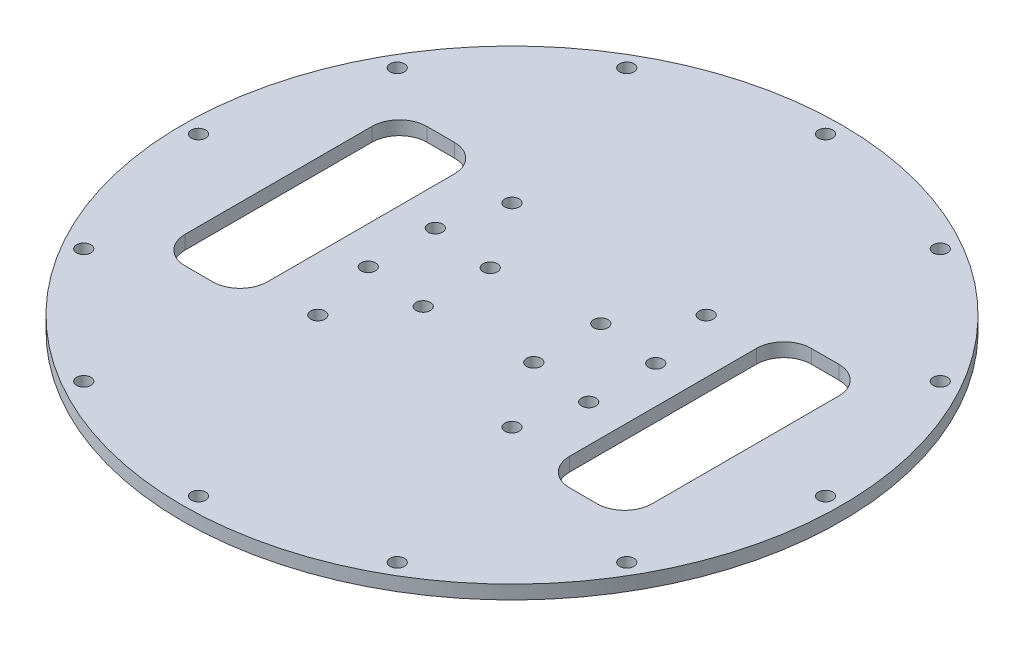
ISO-10303-21;
HEADER;
FILE_DESCRIPTION(('STEP AP214'),'2;1');
FILE_NAME('part.step','',(''),(''),'','','');
FILE_SCHEMA(('AUTOMOTIVE_DESIGN { 1 0 10303 214 1 1 1 1 }'));
ENDSEC;
DATA;
#1=APPLICATION_CONTEXT('core data for automotive mechanical design processes');
#2=APPLICATION_PROTOCOL_DEFINITION('international standard','automotive_design',2000,#1);
#3=PRODUCT_CONTEXT('',#1,'mechanical');
#4=PRODUCT('Part','Part','',(#3));
#5=PRODUCT_RELATED_PRODUCT_CATEGORY('part','',(#4));
#6=PRODUCT_DEFINITION_FORMATION('','',#4);
#7=PRODUCT_DEFINITION_CONTEXT('part definition',#1,'design');
#8=PRODUCT_DEFINITION('design','',#6,#7);
#9=PRODUCT_DEFINITION_SHAPE('','',#8);
#10=(LENGTH_UNIT() NAMED_UNIT(*) SI_UNIT(.MILLI.,.METRE.));
#11=(NAMED_UNIT(*) PLANE_ANGLE_UNIT() SI_UNIT($,.RADIAN.));
#12=(NAMED_UNIT(*) SI_UNIT($,.STERADIAN.) SOLID_ANGLE_UNIT());
#13=UNCERTAINTY_MEASURE_WITH_UNIT(LENGTH_MEASURE(1.E-05),#10,'distance_accuracy_value','');
#14=(GEOMETRIC_REPRESENTATION_CONTEXT(3) GLOBAL_UNCERTAINTY_ASSIGNED_CONTEXT((#13)) GLOBAL_UNIT_ASSIGNED_CONTEXT((#10,
#11,#12)) REPRESENTATION_CONTEXT('',''));
#15=CARTESIAN_POINT('',(0.,0.,0.));
#16=DIRECTION('',(0.,0.,1.));
#17=DIRECTION('',(1.,0.,0.));
#18=AXIS2_PLACEMENT_3D('',#15,#16,#17);
#19=CARTESIAN_POINT('',(-95.25,6.35,43.18));
#20=DIRECTION('',(0.,-1.,0.));
#21=DIRECTION('',(0.,0.,-1.));
#22=AXIS2_PLACEMENT_3D('',#19,#20,#21);
#23=CYLINDRICAL_SURFACE('',#22,12.7);
#24=CARTESIAN_POINT('',(-95.25,0.,43.18));
#25=DIRECTION('',(0.,1.,0.));
#26=DIRECTION('',(0.,0.,1.));
#27=AXIS2_PLACEMENT_3D('',#24,#25,#26);
#28=CIRCLE('',#27,12.7);
#29=CARTESIAN_POINT('',(-107.95,0.,43.18));
#30=VERTEX_POINT('',#29);
#31=CARTESIAN_POINT('',(-95.25,0.,55.88));
#32=VERTEX_POINT('',#31);
#33=EDGE_CURVE('E233',#30,#32,#28,.T.);
#34=ORIENTED_EDGE('',*,*,#33,.F.);
#35=DIRECTION('',(0.,-1.,0.));
#36=VECTOR('',#35,1.);
#37=CARTESIAN_POINT('',(-107.95,6.35,43.18));
#38=LINE('',#37,#36);
#39=CARTESIAN_POINT('',(-107.95,6.35,43.18));
#40=VERTEX_POINT('',#39);
#41=EDGE_CURVE('E11',#40,#30,#38,.T.);
#42=ORIENTED_EDGE('',*,*,#41,.F.);
#43=CARTESIAN_POINT('',(-95.25,6.35,43.18));
#44=DIRECTION('',(0.,1.,0.));
#45=DIRECTION('',(0.,0.,1.));
#46=AXIS2_PLACEMENT_3D('',#43,#44,#45);
#47=CIRCLE('',#46,12.7);
#48=CARTESIAN_POINT('',(-95.25,6.35,55.88));
#49=VERTEX_POINT('',#48);
#50=EDGE_CURVE('E356',#40,#49,#47,.T.);
#51=ORIENTED_EDGE('',*,*,#50,.T.);
#52=DIRECTION('',(0.,-1.,0.));
#53=VECTOR('',#52,1.);
#54=CARTESIAN_POINT('',(-95.25,6.35,55.88));
#55=LINE('',#54,#53);
#56=EDGE_CURVE('E50',#49,#32,#55,.T.);
#57=ORIENTED_EDGE('',*,*,#56,.T.);
#58=EDGE_LOOP('',(#34,#42,#51,#57));
#59=FACE_BOUND('',#58,.T.);
#60=ADVANCED_FACE('F31',(#59),#23,.F.);
#61=CARTESIAN_POINT('',(-107.95,6.35,0.));
#62=DIRECTION('',(1.,0.,0.));
#63=DIRECTION('',(0.,0.,-1.));
#64=AXIS2_PLACEMENT_3D('',#61,#62,#63);
#65=PLANE('',#64);
#66=DIRECTION('',(0.,0.,1.));
#67=VECTOR('',#66,1.);
#68=CARTESIAN_POINT('',(-107.95,0.,0.));
#69=LINE('',#68,#67);
#70=CARTESIAN_POINT('',(-107.95,0.,-43.18));
#71=VERTEX_POINT('',#70);
#72=EDGE_CURVE('E235',#71,#30,#69,.T.);
#73=ORIENTED_EDGE('',*,*,#72,.F.);
#74=DIRECTION('',(0.,-1.,0.));
#75=VECTOR('',#74,1.);
#76=CARTESIAN_POINT('',(-107.95,6.35,-43.18));
#77=LINE('',#76,#75);
#78=CARTESIAN_POINT('',(-107.95,6.35,-43.18));
#79=VERTEX_POINT('',#78);
#80=EDGE_CURVE('E41',#79,#71,#77,.T.);
#81=ORIENTED_EDGE('',*,*,#80,.F.);
#82=DIRECTION('',(0.,0.,1.));
#83=VECTOR('',#82,1.);
#84=CARTESIAN_POINT('',(-107.95,6.35,0.));
#85=LINE('',#84,#83);
#86=EDGE_CURVE('E358',#79,#40,#85,.T.);
#87=ORIENTED_EDGE('',*,*,#86,.T.);
#88=ORIENTED_EDGE('',*,*,#41,.T.);
#89=EDGE_LOOP('',(#73,#81,#87,#88));
#90=FACE_BOUND('',#89,.T.);
#91=ADVANCED_FACE('F389',(#90),#65,.T.);
#92=CARTESIAN_POINT('',(-95.25,6.35,-43.18));
#93=DIRECTION('',(0.,-1.,0.));
#94=DIRECTION('',(0.,0.,-1.));
#95=AXIS2_PLACEMENT_3D('',#92,#93,#94);
#96=CYLINDRICAL_SURFACE('',#95,12.7);
#97=CARTESIAN_POINT('',(-95.25,0.,-43.18));
#98=DIRECTION('',(0.,1.,0.));
#99=DIRECTION('',(0.,0.,1.));
#100=AXIS2_PLACEMENT_3D('',#97,#98,#99);
#101=CIRCLE('',#100,12.7);
#102=CARTESIAN_POINT('',(-95.25,0.,-55.88));
#103=VERTEX_POINT('',#102);
#104=EDGE_CURVE('E238',#103,#71,#101,.T.);
#105=ORIENTED_EDGE('',*,*,#104,.F.);
#106=DIRECTION('',(0.,-1.,0.));
#107=VECTOR('',#106,1.);
#108=CARTESIAN_POINT('',(-95.25,6.35,-55.88));
#109=LINE('',#108,#107);
#110=CARTESIAN_POINT('',(-95.25,6.35,-55.88));
#111=VERTEX_POINT('',#110);
#112=EDGE_CURVE('E274',#111,#103,#109,.T.);
#113=ORIENTED_EDGE('',*,*,#112,.F.);
#114=CARTESIAN_POINT('',(-95.25,6.35,-43.18));
#115=DIRECTION('',(0.,1.,0.));
#116=DIRECTION('',(0.,0.,1.));
#117=AXIS2_PLACEMENT_3D('',#114,#115,#116);
#118=CIRCLE('',#117,12.7);
#119=EDGE_CURVE('E361',#111,#79,#118,.T.);
#120=ORIENTED_EDGE('',*,*,#119,.T.);
#121=ORIENTED_EDGE('',*,*,#80,.T.);
#122=EDGE_LOOP('',(#105,#113,#120,#121));
#123=FACE_BOUND('',#122,.T.);
#124=ADVANCED_FACE('F394',(#123),#96,.F.);
#125=CARTESIAN_POINT('',(-335.421421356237,6.35,-55.88));
#126=DIRECTION('',(0.,0.,1.));
#127=DIRECTION('',(1.,0.,0.));
#128=AXIS2_PLACEMENT_3D('',#125,#126,#127);
#129=PLANE('',#128);
#130=DIRECTION('',(-1.,0.,0.));
#131=VECTOR('',#130,1.);
#132=CARTESIAN_POINT('',(-335.421421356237,0.,-55.88));
#133=LINE('',#132,#131);
#134=CARTESIAN_POINT('',(-82.55,0.,-55.88));
#135=VERTEX_POINT('',#134);
#136=EDGE_CURVE('E241',#135,#103,#133,.T.);
#137=ORIENTED_EDGE('',*,*,#136,.F.);
#138=DIRECTION('',(0.,-1.,0.));
#139=VECTOR('',#138,1.);
#140=CARTESIAN_POINT('',(-82.55,6.35,-55.88));
#141=LINE('',#140,#139);
#142=CARTESIAN_POINT('',(-82.55,6.35,-55.88));
#143=VERTEX_POINT('',#142);
#144=EDGE_CURVE('E272',#143,#135,#141,.T.);
#145=ORIENTED_EDGE('',*,*,#144,.F.);
#146=DIRECTION('',(-1.,0.,0.));
#147=VECTOR('',#146,1.);
#148=CARTESIAN_POINT('',(-335.421421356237,6.35,-55.88));
#149=LINE('',#148,#147);
#150=EDGE_CURVE('E364',#143,#111,#149,.T.);
#151=ORIENTED_EDGE('',*,*,#150,.T.);
#152=ORIENTED_EDGE('',*,*,#112,.T.);
#153=EDGE_LOOP('',(#137,#145,#151,#152));
#154=FACE_BOUND('',#153,.T.);
#155=ADVANCED_FACE('F437',(#154),#129,.T.);
#156=CARTESIAN_POINT('',(-82.55,6.35,-43.18));
#157=DIRECTION('',(0.,-1.,0.));
#158=DIRECTION('',(0.,0.,-1.));
#159=AXIS2_PLACEMENT_3D('',#156,#157,#158);
#160=CYLINDRICAL_SURFACE('',#159,12.7);
#161=CARTESIAN_POINT('',(-82.55,0.,-43.18));
#162=DIRECTION('',(0.,1.,0.));
#163=DIRECTION('',(0.,0.,1.));
#164=AXIS2_PLACEMENT_3D('',#161,#162,#163);
#165=CIRCLE('',#164,12.7);
#166=CARTESIAN_POINT('',(-69.85,0.,-43.18));
#167=VERTEX_POINT('',#166);
#168=EDGE_CURVE('E244',#167,#135,#165,.T.);
#169=ORIENTED_EDGE('',*,*,#168,.F.);
#170=DIRECTION('',(0.,-1.,0.));
#171=VECTOR('',#170,1.);
#172=CARTESIAN_POINT('',(-69.85,6.35,-43.18));
#173=LINE('',#172,#171);
#174=CARTESIAN_POINT('',(-69.85,6.35,-43.18));
#175=VERTEX_POINT('',#174);
#176=EDGE_CURVE('E160',#175,#167,#173,.T.);
#177=ORIENTED_EDGE('',*,*,#176,.F.);
#178=CARTESIAN_POINT('',(-82.55,6.35,-43.18));
#179=DIRECTION('',(0.,1.,0.));
#180=DIRECTION('',(0.,0.,1.));
#181=AXIS2_PLACEMENT_3D('',#178,#179,#180);
#182=CIRCLE('',#181,12.7);
#183=EDGE_CURVE('E172',#175,#143,#182,.T.);
#184=ORIENTED_EDGE('',*,*,#183,.T.);
#185=ORIENTED_EDGE('',*,*,#144,.T.);
#186=EDGE_LOOP('',(#169,#177,#184,#185));
#187=FACE_BOUND('',#186,.T.);
#188=ADVANCED_FACE('F368',(#187),#160,.F.);
#189=CARTESIAN_POINT('',(-69.85,6.35,0.));
#190=DIRECTION('',(-1.,0.,0.));
#191=DIRECTION('',(0.,0.,1.));
#192=AXIS2_PLACEMENT_3D('',#189,#190,#191);
#193=PLANE('',#192);
#194=DIRECTION('',(0.,0.,-1.));
#195=VECTOR('',#194,1.);
#196=CARTESIAN_POINT('',(-69.85,0.,0.));
#197=LINE('',#196,#195);
#198=CARTESIAN_POINT('',(-69.85,0.,43.18));
#199=VERTEX_POINT('',#198);
#200=EDGE_CURVE('E156',#199,#167,#197,.T.);
#201=ORIENTED_EDGE('',*,*,#200,.F.);
#202=DIRECTION('',(0.,-1.,0.));
#203=VECTOR('',#202,1.);
#204=CARTESIAN_POINT('',(-69.85,6.35,43.18));
#205=LINE('',#204,#203);
#206=CARTESIAN_POINT('',(-69.85,6.35,43.18));
#207=VERTEX_POINT('',#206);
#208=EDGE_CURVE('E151',#207,#199,#205,.T.);
#209=ORIENTED_EDGE('',*,*,#208,.F.);
#210=DIRECTION('',(0.,0.,-1.));
#211=VECTOR('',#210,1.);
#212=CARTESIAN_POINT('',(-69.85,6.35,0.));
#213=LINE('',#212,#211);
#214=EDGE_CURVE('E154',#207,#175,#213,.T.);
#215=ORIENTED_EDGE('',*,*,#214,.T.);
#216=ORIENTED_EDGE('',*,*,#176,.T.);
#217=EDGE_LOOP('',(#201,#209,#215,#216));
#218=FACE_BOUND('',#217,.T.);
#219=ADVANCED_FACE('F153',(#218),#193,.T.);
#220=CARTESIAN_POINT('',(-82.55,6.35,43.18));
#221=DIRECTION('',(0.,-1.,0.));
#222=DIRECTION('',(0.,0.,-1.));
#223=AXIS2_PLACEMENT_3D('',#220,#221,#222);
#224=CYLINDRICAL_SURFACE('',#223,12.7);
#225=CARTESIAN_POINT('',(-82.55,0.,43.18));
#226=DIRECTION('',(0.,1.,0.));
#227=DIRECTION('',(0.,0.,1.));
#228=AXIS2_PLACEMENT_3D('',#225,#226,#227);
#229=CIRCLE('',#228,12.7);
#230=CARTESIAN_POINT('',(-82.55,0.,55.88));
#231=VERTEX_POINT('',#230);
#232=EDGE_CURVE('E248',#231,#199,#229,.T.);
#233=ORIENTED_EDGE('',*,*,#232,.F.);
#234=DIRECTION('',(0.,-1.,0.));
#235=VECTOR('',#234,1.);
#236=CARTESIAN_POINT('',(-82.55,6.35,55.88));
#237=LINE('',#236,#235);
#238=CARTESIAN_POINT('',(-82.55,6.35,55.88));
#239=VERTEX_POINT('',#238);
#240=EDGE_CURVE('E99',#239,#231,#237,.T.);
#241=ORIENTED_EDGE('',*,*,#240,.F.);
#242=CARTESIAN_POINT('',(-82.55,6.35,43.18));
#243=DIRECTION('',(0.,1.,0.));
#244=DIRECTION('',(0.,0.,1.));
#245=AXIS2_PLACEMENT_3D('',#242,#243,#244);
#246=CIRCLE('',#245,12.7);
#247=EDGE_CURVE('E169',#239,#207,#246,.T.);
#248=ORIENTED_EDGE('',*,*,#247,.T.);
#249=ORIENTED_EDGE('',*,*,#208,.T.);
#250=EDGE_LOOP('',(#233,#241,#248,#249));
#251=FACE_BOUND('',#250,.T.);
#252=ADVANCED_FACE('F174',(#251),#224,.F.);
#253=CARTESIAN_POINT('',(82.55,6.35,43.18));
#254=DIRECTION('',(0.,-1.,0.));
#255=DIRECTION('',(0.,0.,-1.));
#256=AXIS2_PLACEMENT_3D('',#253,#254,#255);
#257=CYLINDRICAL_SURFACE('',#256,12.7);
#258=CARTESIAN_POINT('',(82.55,0.,43.18));
#259=DIRECTION('',(0.,1.,0.));
#260=DIRECTION('',(0.,0.,1.));
#261=AXIS2_PLACEMENT_3D('',#258,#259,#260);
#262=CIRCLE('',#261,12.7);
#263=CARTESIAN_POINT('',(69.85,0.,43.18));
#264=VERTEX_POINT('',#263);
#265=CARTESIAN_POINT('',(82.55,0.,55.88));
#266=VERTEX_POINT('',#265);
#267=EDGE_CURVE('E196',#264,#266,#262,.T.);
#268=ORIENTED_EDGE('',*,*,#267,.F.);
#269=DIRECTION('',(0.,-1.,0.));
#270=VECTOR('',#269,1.);
#271=CARTESIAN_POINT('',(69.85,6.35,43.18));
#272=LINE('',#271,#270);
#273=CARTESIAN_POINT('',(69.85,6.35,43.18));
#274=VERTEX_POINT('',#273);
#275=EDGE_CURVE('E35',#274,#264,#272,.T.);
#276=ORIENTED_EDGE('',*,*,#275,.F.);
#277=CARTESIAN_POINT('',(82.55,6.35,43.18));
#278=DIRECTION('',(0.,1.,0.));
#279=DIRECTION('',(0.,0.,1.));
#280=AXIS2_PLACEMENT_3D('',#277,#278,#279);
#281=CIRCLE('',#280,12.7);
#282=CARTESIAN_POINT('',(82.55,6.35,55.88));
#283=VERTEX_POINT('',#282);
#284=EDGE_CURVE('E268',#274,#283,#281,.T.);
#285=ORIENTED_EDGE('',*,*,#284,.T.);
#286=DIRECTION('',(0.,-1.,0.));
#287=VECTOR('',#286,1.);
#288=CARTESIAN_POINT('',(82.55,6.35,55.88));
#289=LINE('',#288,#287);
#290=EDGE_CURVE('E195',#283,#266,#289,.T.);
#291=ORIENTED_EDGE('',*,*,#290,.T.);
#292=EDGE_LOOP('',(#268,#276,#285,#291));
#293=FACE_BOUND('',#292,.T.);
#294=ADVANCED_FACE('F33',(#293),#257,.F.);
#295=CARTESIAN_POINT('',(69.85,6.35,0.));
#296=DIRECTION('',(-1.,0.,0.));
#297=DIRECTION('',(0.,0.,1.));
#298=AXIS2_PLACEMENT_3D('',#295,#296,#297);
#299=PLANE('',#298);
#300=DIRECTION('',(0.,0.,-1.));
#301=VECTOR('',#300,1.);
#302=CARTESIAN_POINT('',(69.85,0.,0.));
#303=LINE('',#302,#301);
#304=CARTESIAN_POINT('',(69.85,0.,-43.18));
#305=VERTEX_POINT('',#304);
#306=EDGE_CURVE('E199',#264,#305,#303,.T.);
#307=ORIENTED_EDGE('',*,*,#306,.T.);
#308=DIRECTION('',(0.,-1.,0.));
#309=VECTOR('',#308,1.);
#310=CARTESIAN_POINT('',(69.85,6.35,-43.18));
#311=LINE('',#310,#309);
#312=CARTESIAN_POINT('',(69.85,6.35,-43.18));
#313=VERTEX_POINT('',#312);
#314=EDGE_CURVE('E287',#313,#305,#311,.T.);
#315=ORIENTED_EDGE('',*,*,#314,.F.);
#316=DIRECTION('',(0.,0.,-1.));
#317=VECTOR('',#316,1.);
#318=CARTESIAN_POINT('',(69.85,6.35,0.));
#319=LINE('',#318,#317);
#320=EDGE_CURVE('E295',#274,#313,#319,.T.);
#321=ORIENTED_EDGE('',*,*,#320,.F.);
#322=ORIENTED_EDGE('',*,*,#275,.T.);
#323=EDGE_LOOP('',(#307,#315,#321,#322));
#324=FACE_BOUND('',#323,.T.);
#325=ADVANCED_FACE('F294',(#324),#299,.F.);
#326=CARTESIAN_POINT('',(82.55,6.35,-43.18));
#327=DIRECTION('',(0.,-1.,0.));
#328=DIRECTION('',(0.,0.,-1.));
#329=AXIS2_PLACEMENT_3D('',#326,#327,#328);
#330=CYLINDRICAL_SURFACE('',#329,12.7);
#331=CARTESIAN_POINT('',(82.55,0.,-43.18));
#332=DIRECTION('',(0.,1.,0.));
#333=DIRECTION('',(0.,0.,1.));
#334=AXIS2_PLACEMENT_3D('',#331,#332,#333);
#335=CIRCLE('',#334,12.7);
#336=CARTESIAN_POINT('',(82.55,0.,-55.88));
#337=VERTEX_POINT('',#336);
#338=EDGE_CURVE('E203',#337,#305,#335,.T.);
#339=ORIENTED_EDGE('',*,*,#338,.F.);
#340=DIRECTION('',(0.,-1.,0.));
#341=VECTOR('',#340,1.);
#342=CARTESIAN_POINT('',(82.55,6.35,-55.88));
#343=LINE('',#342,#341);
#344=CARTESIAN_POINT('',(82.55,6.35,-55.88));
#345=VERTEX_POINT('',#344);
#346=EDGE_CURVE('E286',#345,#337,#343,.T.);
#347=ORIENTED_EDGE('',*,*,#346,.F.);
#348=CARTESIAN_POINT('',(82.55,6.35,-43.18));
#349=DIRECTION('',(0.,1.,0.));
#350=DIRECTION('',(0.,0.,1.));
#351=AXIS2_PLACEMENT_3D('',#348,#349,#350);
#352=CIRCLE('',#351,12.7);
#353=EDGE_CURVE('E329',#345,#313,#352,.T.);
#354=ORIENTED_EDGE('',*,*,#353,.T.);
#355=ORIENTED_EDGE('',*,*,#314,.T.);
#356=EDGE_LOOP('',(#339,#347,#354,#355));
#357=FACE_BOUND('',#356,.T.);
#358=ADVANCED_FACE('F327',(#357),#330,.F.);
#359=CARTESIAN_POINT('',(-335.421421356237,6.35,-55.88));
#360=DIRECTION('',(0.,0.,-1.));
#361=DIRECTION('',(-1.,0.,0.));
#362=AXIS2_PLACEMENT_3D('',#359,#360,#361);
#363=PLANE('',#362);
#364=DIRECTION('',(1.,0.,0.));
#365=VECTOR('',#364,1.);
#366=CARTESIAN_POINT('',(-335.421421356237,0.,-55.88));
#367=LINE('',#366,#365);
#368=CARTESIAN_POINT('',(95.25,0.,-55.88));
#369=VERTEX_POINT('',#368);
#370=EDGE_CURVE('E206',#337,#369,#367,.T.);
#371=ORIENTED_EDGE('',*,*,#370,.T.);
#372=DIRECTION('',(0.,-1.,0.));
#373=VECTOR('',#372,1.);
#374=CARTESIAN_POINT('',(95.25,6.35,-55.88));
#375=LINE('',#374,#373);
#376=CARTESIAN_POINT('',(95.25,6.35,-55.88));
#377=VERTEX_POINT('',#376);
#378=EDGE_CURVE('E284',#377,#369,#375,.T.);
#379=ORIENTED_EDGE('',*,*,#378,.F.);
#380=DIRECTION('',(1.,0.,0.));
#381=VECTOR('',#380,1.);
#382=CARTESIAN_POINT('',(-335.421421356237,6.35,-55.88));
#383=LINE('',#382,#381);
#384=EDGE_CURVE('E330',#345,#377,#383,.T.);
#385=ORIENTED_EDGE('',*,*,#384,.F.);
#386=ORIENTED_EDGE('',*,*,#346,.T.);
#387=EDGE_LOOP('',(#371,#379,#385,#386));
#388=FACE_BOUND('',#387,.T.);
#389=ADVANCED_FACE('F326',(#388),#363,.F.);
#390=CARTESIAN_POINT('',(95.25,6.35,-43.18));
#391=DIRECTION('',(0.,-1.,0.));
#392=DIRECTION('',(0.,0.,-1.));
#393=AXIS2_PLACEMENT_3D('',#390,#391,#392);
#394=CYLINDRICAL_SURFACE('',#393,12.7);
#395=CARTESIAN_POINT('',(95.25,0.,-43.18));
#396=DIRECTION('',(0.,1.,0.));
#397=DIRECTION('',(0.,0.,1.));
#398=AXIS2_PLACEMENT_3D('',#395,#396,#397);
#399=CIRCLE('',#398,12.7);
#400=CARTESIAN_POINT('',(107.95,0.,-43.18));
#401=VERTEX_POINT('',#400);
#402=EDGE_CURVE('E209',#401,#369,#399,.T.);
#403=ORIENTED_EDGE('',*,*,#402,.F.);
#404=DIRECTION('',(0.,-1.,0.));
#405=VECTOR('',#404,1.);
#406=CARTESIAN_POINT('',(107.95,6.35,-43.18));
#407=LINE('',#406,#405);
#408=CARTESIAN_POINT('',(107.95,6.35,-43.18));
#409=VERTEX_POINT('',#408);
#410=EDGE_CURVE('E282',#409,#401,#407,.T.);
#411=ORIENTED_EDGE('',*,*,#410,.F.);
#412=CARTESIAN_POINT('',(95.25,6.35,-43.18));
#413=DIRECTION('',(0.,1.,0.));
#414=DIRECTION('',(0.,0.,1.));
#415=AXIS2_PLACEMENT_3D('',#412,#413,#414);
#416=CIRCLE('',#415,12.7);
#417=EDGE_CURVE('E323',#409,#377,#416,.T.);
#418=ORIENTED_EDGE('',*,*,#417,.T.);
#419=ORIENTED_EDGE('',*,*,#378,.T.);
#420=EDGE_LOOP('',(#403,#411,#418,#419));
#421=FACE_BOUND('',#420,.T.);
#422=ADVANCED_FACE('F319',(#421),#394,.F.);
#423=CARTESIAN_POINT('',(107.95,6.35,0.));
#424=DIRECTION('',(1.,0.,0.));
#425=DIRECTION('',(0.,0.,-1.));
#426=AXIS2_PLACEMENT_3D('',#423,#424,#425);
#427=PLANE('',#426);
#428=DIRECTION('',(0.,0.,1.));
#429=VECTOR('',#428,1.);
#430=CARTESIAN_POINT('',(107.95,0.,0.));
#431=LINE('',#430,#429);
#432=CARTESIAN_POINT('',(107.95,0.,43.18));
#433=VERTEX_POINT('',#432);
#434=EDGE_CURVE('E212',#401,#433,#431,.T.);
#435=ORIENTED_EDGE('',*,*,#434,.T.);
#436=DIRECTION('',(0.,-1.,0.));
#437=VECTOR('',#436,1.);
#438=CARTESIAN_POINT('',(107.95,6.35,43.18));
#439=LINE('',#438,#437);
#440=CARTESIAN_POINT('',(107.95,6.35,43.18));
#441=VERTEX_POINT('',#440);
#442=EDGE_CURVE('E280',#441,#433,#439,.T.);
#443=ORIENTED_EDGE('',*,*,#442,.F.);
#444=DIRECTION('',(0.,0.,1.));
#445=VECTOR('',#444,1.);
#446=CARTESIAN_POINT('',(107.95,6.35,0.));
#447=LINE('',#446,#445);
#448=EDGE_CURVE('E339',#409,#441,#447,.T.);
#449=ORIENTED_EDGE('',*,*,#448,.F.);
#450=ORIENTED_EDGE('',*,*,#410,.T.);
#451=EDGE_LOOP('',(#435,#443,#449,#450));
#452=FACE_BOUND('',#451,.T.);
#453=ADVANCED_FACE('F316',(#452),#427,.F.);
#454=CARTESIAN_POINT('',(95.25,6.35,43.18));
#455=DIRECTION('',(0.,-1.,0.));
#456=DIRECTION('',(0.,0.,-1.));
#457=AXIS2_PLACEMENT_3D('',#454,#455,#456);
#458=CYLINDRICAL_SURFACE('',#457,12.7);
#459=CARTESIAN_POINT('',(95.25,0.,43.18));
#460=DIRECTION('',(0.,1.,0.));
#461=DIRECTION('',(0.,0.,1.));
#462=AXIS2_PLACEMENT_3D('',#459,#460,#461);
#463=CIRCLE('',#462,12.7);
#464=CARTESIAN_POINT('',(95.25,0.,55.88));
#465=VERTEX_POINT('',#464);
#466=EDGE_CURVE('E215',#465,#433,#463,.T.);
#467=ORIENTED_EDGE('',*,*,#466,.F.);
#468=DIRECTION('',(0.,-1.,0.));
#469=VECTOR('',#468,1.);
#470=CARTESIAN_POINT('',(95.25,6.35,55.88));
#471=LINE('',#470,#469);
#472=CARTESIAN_POINT('',(95.25,6.35,55.88));
#473=VERTEX_POINT('',#472);
#474=EDGE_CURVE('E278',#473,#465,#471,.T.);
#475=ORIENTED_EDGE('',*,*,#474,.F.);
#476=CARTESIAN_POINT('',(95.25,6.35,43.18));
#477=DIRECTION('',(0.,1.,0.));
#478=DIRECTION('',(0.,0.,1.));
#479=AXIS2_PLACEMENT_3D('',#476,#477,#478);
#480=CIRCLE('',#479,12.7);
#481=EDGE_CURVE('E313',#473,#441,#480,.T.);
#482=ORIENTED_EDGE('',*,*,#481,.T.);
#483=ORIENTED_EDGE('',*,*,#442,.T.);
#484=EDGE_LOOP('',(#467,#475,#482,#483));
#485=FACE_BOUND('',#484,.T.);
#486=ADVANCED_FACE('F309',(#485),#458,.F.);
#487=CARTESIAN_POINT('',(-23.98131856,6.35,-13.91245376));
#488=DIRECTION('',(0.,-1.,0.));
#489=DIRECTION('',(0.,0.,-1.));
#490=AXIS2_PLACEMENT_3D('',#487,#488,#489);
#491=CYLINDRICAL_SURFACE('',#490,3.302);
#492=CARTESIAN_POINT('',(-23.98131856,6.35,-13.91245376));
#493=DIRECTION('',(0.,1.,0.));
#494=DIRECTION('',(0.,0.,1.));
#495=AXIS2_PLACEMENT_3D('',#492,#493,#494);
#496=CIRCLE('',#495,3.302);
#497=CARTESIAN_POINT('',(-23.98131856,6.35,-10.61045376));
#498=VERTEX_POINT('',#497);
#499=EDGE_CURVE('E189',#498,#498,#496,.T.);
#500=ORIENTED_EDGE('',*,*,#499,.T.);
#501=EDGE_LOOP('',(#500));
#502=FACE_BOUND('',#501,.T.);
#503=CARTESIAN_POINT('',(-23.98131856,0.,-13.91245376));
#504=DIRECTION('',(0.,1.,0.));
#505=DIRECTION('',(0.,0.,1.));
#506=AXIS2_PLACEMENT_3D('',#503,#504,#505);
#507=CIRCLE('',#506,3.302);
#508=CARTESIAN_POINT('',(-23.98131856,0.,-10.61045376));
#509=VERTEX_POINT('',#508);
#510=EDGE_CURVE('E262',#509,#509,#507,.T.);
#511=ORIENTED_EDGE('',*,*,#510,.F.);
#512=EDGE_LOOP('',(#511));
#513=FACE_BOUND('',#512,.T.);
#514=ADVANCED_FACE('F415',(#502,#513),#491,.F.);
#515=CARTESIAN_POINT('',(-23.98131856,6.35,17.08745376));
#516=DIRECTION('',(0.,-1.,0.));
#517=DIRECTION('',(0.,0.,-1.));
#518=AXIS2_PLACEMENT_3D('',#515,#516,#517);
#519=CYLINDRICAL_SURFACE('',#518,3.302);
#520=CARTESIAN_POINT('',(-23.98131856,6.35,17.08745376));
#521=DIRECTION('',(0.,1.,0.));
#522=DIRECTION('',(0.,0.,1.));
#523=AXIS2_PLACEMENT_3D('',#520,#521,#522);
#524=CIRCLE('',#523,3.302);
#525=CARTESIAN_POINT('',(-23.98131856,6.35,20.38945376));
#526=VERTEX_POINT('',#525);
#527=EDGE_CURVE('E186',#526,#526,#524,.T.);
#528=ORIENTED_EDGE('',*,*,#527,.T.);
#529=EDGE_LOOP('',(#528));
#530=FACE_BOUND('',#529,.T.);
#531=CARTESIAN_POINT('',(-23.98131856,0.,17.08745376));
#532=DIRECTION('',(0.,1.,0.));
#533=DIRECTION('',(0.,0.,1.));
#534=AXIS2_PLACEMENT_3D('',#531,#532,#533);
#535=CIRCLE('',#534,3.302);
#536=CARTESIAN_POINT('',(-23.98131856,0.,20.38945376));
#537=VERTEX_POINT('',#536);
#538=EDGE_CURVE('E259',#537,#537,#535,.T.);
#539=ORIENTED_EDGE('',*,*,#538,.F.);
#540=EDGE_LOOP('',(#539));
#541=FACE_BOUND('',#540,.T.);
#542=ADVANCED_FACE('F513',(#530,#541),#519,.F.);
#543=CARTESIAN_POINT('',(-52.55631856,6.35,-17.08745376));
#544=DIRECTION('',(0.,-1.,0.));
#545=DIRECTION('',(0.,0.,-1.));
#546=AXIS2_PLACEMENT_3D('',#543,#544,#545);
#547=CYLINDRICAL_SURFACE('',#546,3.302);
#548=CARTESIAN_POINT('',(-52.55631856,6.35,-17.08745376));
#549=DIRECTION('',(0.,1.,0.));
#550=DIRECTION('',(0.,0.,1.));
#551=AXIS2_PLACEMENT_3D('',#548,#549,#550);
#552=CIRCLE('',#551,3.302);
#553=CARTESIAN_POINT('',(-52.55631856,6.35,-13.78545376));
#554=VERTEX_POINT('',#553);
#555=EDGE_CURVE('E183',#554,#554,#552,.T.);
#556=ORIENTED_EDGE('',*,*,#555,.T.);
#557=EDGE_LOOP('',(#556));
#558=FACE_BOUND('',#557,.T.);
#559=CARTESIAN_POINT('',(-52.55631856,0.,-17.08745376));
#560=DIRECTION('',(0.,1.,0.));
#561=DIRECTION('',(0.,0.,1.));
#562=AXIS2_PLACEMENT_3D('',#559,#560,#561);
#563=CIRCLE('',#562,3.302);
#564=CARTESIAN_POINT('',(-52.55631856,0.,-13.78545376));
#565=VERTEX_POINT('',#564);
#566=EDGE_CURVE('E256',#565,#565,#563,.T.);
#567=ORIENTED_EDGE('',*,*,#566,.F.);
#568=EDGE_LOOP('',(#567));
#569=FACE_BOUND('',#568,.T.);
#570=ADVANCED_FACE('F384',(#558,#569),#547,.F.);
#571=CARTESIAN_POINT('',(-52.55631856,6.35,13.91245376));
#572=DIRECTION('',(0.,-1.,0.));
#573=DIRECTION('',(0.,0.,-1.));
#574=AXIS2_PLACEMENT_3D('',#571,#572,#573);
#575=CYLINDRICAL_SURFACE('',#574,3.302);
#576=CARTESIAN_POINT('',(-52.55631856,6.35,13.91245376));
#577=DIRECTION('',(0.,1.,0.));
#578=DIRECTION('',(0.,0.,1.));
#579=AXIS2_PLACEMENT_3D('',#576,#577,#578);
#580=CIRCLE('',#579,3.302);
#581=CARTESIAN_POINT('',(-52.55631856,6.35,17.21445376));
#582=VERTEX_POINT('',#581);
#583=EDGE_CURVE('E177',#582,#582,#580,.T.);
#584=ORIENTED_EDGE('',*,*,#583,.T.);
#585=EDGE_LOOP('',(#584));
#586=FACE_BOUND('',#585,.T.);
#587=CARTESIAN_POINT('',(-52.55631856,0.,13.91245376));
#588=DIRECTION('',(0.,1.,0.));
#589=DIRECTION('',(0.,0.,1.));
#590=AXIS2_PLACEMENT_3D('',#587,#588,#589);
#591=CIRCLE('',#590,3.302);
#592=CARTESIAN_POINT('',(-52.55631856,0.,17.21445376));
#593=VERTEX_POINT('',#592);
#594=EDGE_CURVE('E253',#593,#593,#591,.T.);
#595=ORIENTED_EDGE('',*,*,#594,.F.);
#596=EDGE_LOOP('',(#595));
#597=FACE_BOUND('',#596,.T.);
#598=ADVANCED_FACE('F375',(#586,#597),#575,.F.);
#599=CARTESIAN_POINT('',(-335.421421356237,6.35,55.88));
#600=DIRECTION('',(0.,0.,-1.));
#601=DIRECTION('',(-1.,0.,0.));
#602=AXIS2_PLACEMENT_3D('',#599,#600,#601);
#603=PLANE('',#602);
#604=DIRECTION('',(1.,0.,0.));
#605=VECTOR('',#604,1.);
#606=CARTESIAN_POINT('',(-335.421421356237,0.,55.88));
#607=LINE('',#606,#605);
#608=EDGE_CURVE('E250',#32,#231,#607,.T.);
#609=ORIENTED_EDGE('',*,*,#608,.F.);
#610=ORIENTED_EDGE('',*,*,#56,.F.);
#611=DIRECTION('',(1.,0.,0.));
#612=VECTOR('',#611,1.);
#613=CARTESIAN_POINT('',(-335.421421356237,6.35,55.88));
#614=LINE('',#613,#612);
#615=EDGE_CURVE('E175',#49,#239,#614,.T.);
#616=ORIENTED_EDGE('',*,*,#615,.T.);
#617=ORIENTED_EDGE('',*,*,#240,.T.);
#618=EDGE_LOOP('',(#609,#610,#616,#617));
#619=FACE_BOUND('',#618,.T.);
#620=ADVANCED_FACE('F372',(#619),#603,.T.);
#621=CARTESIAN_POINT('',(23.98131856,6.35,13.91245376));
#622=DIRECTION('',(0.,-1.,0.));
#623=DIRECTION('',(0.,0.,-1.));
#624=AXIS2_PLACEMENT_3D('',#621,#622,#623);
#625=CYLINDRICAL_SURFACE('',#624,3.302);
#626=CARTESIAN_POINT('',(23.98131856,6.35,13.91245376));
#627=DIRECTION('',(0.,1.,0.));
#628=DIRECTION('',(0.,0.,1.));
#629=AXIS2_PLACEMENT_3D('',#626,#627,#628);
#630=CIRCLE('',#629,3.302);
#631=CARTESIAN_POINT('',(23.98131856,6.35,17.21445376));
#632=VERTEX_POINT('',#631);
#633=EDGE_CURVE('E353',#632,#632,#630,.T.);
#634=ORIENTED_EDGE('',*,*,#633,.T.);
#635=EDGE_LOOP('',(#634));
#636=FACE_BOUND('',#635,.T.);
#637=CARTESIAN_POINT('',(23.98131856,0.,13.91245376));
#638=DIRECTION('',(0.,1.,0.));
#639=DIRECTION('',(0.,0.,1.));
#640=AXIS2_PLACEMENT_3D('',#637,#638,#639);
#641=CIRCLE('',#640,3.302);
#642=CARTESIAN_POINT('',(23.98131856,0.,17.21445376));
#643=VERTEX_POINT('',#642);
#644=EDGE_CURVE('E230',#643,#643,#641,.T.);
#645=ORIENTED_EDGE('',*,*,#644,.F.);
#646=EDGE_LOOP('',(#645));
#647=FACE_BOUND('',#646,.T.);
#648=ADVANCED_FACE('F374',(#636,#647),#625,.F.);
#649=CARTESIAN_POINT('',(23.98131856,6.35,-17.08745376));
#650=DIRECTION('',(0.,-1.,0.));
#651=DIRECTION('',(0.,0.,-1.));
#652=AXIS2_PLACEMENT_3D('',#649,#650,#651);
#653=CYLINDRICAL_SURFACE('',#652,3.302);
#654=CARTESIAN_POINT('',(23.98131856,6.35,-17.08745376));
#655=DIRECTION('',(0.,1.,0.));
#656=DIRECTION('',(0.,0.,1.));
#657=AXIS2_PLACEMENT_3D('',#654,#655,#656);
#658=CIRCLE('',#657,3.302);
#659=CARTESIAN_POINT('',(23.98131856,6.35,-13.78545376));
#660=VERTEX_POINT('',#659);
#661=EDGE_CURVE('E350',#660,#660,#658,.T.);
#662=ORIENTED_EDGE('',*,*,#661,.T.);
#663=EDGE_LOOP('',(#662));
#664=FACE_BOUND('',#663,.T.);
#665=CARTESIAN_POINT('',(23.98131856,0.,-17.08745376));
#666=DIRECTION('',(0.,1.,0.));
#667=DIRECTION('',(0.,0.,1.));
#668=AXIS2_PLACEMENT_3D('',#665,#666,#667);
#669=CIRCLE('',#668,3.302);
#670=CARTESIAN_POINT('',(23.98131856,0.,-13.78545376));
#671=VERTEX_POINT('',#670);
#672=EDGE_CURVE('E227',#671,#671,#669,.T.);
#673=ORIENTED_EDGE('',*,*,#672,.F.);
#674=EDGE_LOOP('',(#673));
#675=FACE_BOUND('',#674,.T.);
#676=ADVANCED_FACE('F381',(#664,#675),#653,.F.);
#677=CARTESIAN_POINT('',(52.55631856,6.35,17.08745376));
#678=DIRECTION('',(0.,-1.,0.));
#679=DIRECTION('',(0.,0.,-1.));
#680=AXIS2_PLACEMENT_3D('',#677,#678,#679);
#681=CYLINDRICAL_SURFACE('',#680,3.302);
#682=CARTESIAN_POINT('',(52.55631856,6.35,17.08745376));
#683=DIRECTION('',(0.,1.,0.));
#684=DIRECTION('',(0.,0.,1.));
#685=AXIS2_PLACEMENT_3D('',#682,#683,#684);
#686=CIRCLE('',#685,3.302);
#687=CARTESIAN_POINT('',(52.55631856,6.35,20.38945376));
#688=VERTEX_POINT('',#687);
#689=EDGE_CURVE('E347',#688,#688,#686,.T.);
#690=ORIENTED_EDGE('',*,*,#689,.T.);
#691=EDGE_LOOP('',(#690));
#692=FACE_BOUND('',#691,.T.);
#693=CARTESIAN_POINT('',(52.55631856,0.,17.08745376));
#694=DIRECTION('',(0.,1.,0.));
#695=DIRECTION('',(0.,0.,1.));
#696=AXIS2_PLACEMENT_3D('',#693,#694,#695);
#697=CIRCLE('',#696,3.302);
#698=CARTESIAN_POINT('',(52.55631856,0.,20.38945376));
#699=VERTEX_POINT('',#698);
#700=EDGE_CURVE('E224',#699,#699,#697,.T.);
#701=ORIENTED_EDGE('',*,*,#700,.F.);
#702=EDGE_LOOP('',(#701));
#703=FACE_BOUND('',#702,.T.);
#704=ADVANCED_FACE('F401',(#692,#703),#681,.F.);
#705=CARTESIAN_POINT('',(52.55631856,6.35,-13.91245376));
#706=DIRECTION('',(0.,-1.,0.));
#707=DIRECTION('',(0.,0.,-1.));
#708=AXIS2_PLACEMENT_3D('',#705,#706,#707);
#709=CYLINDRICAL_SURFACE('',#708,3.302);
#710=CARTESIAN_POINT('',(52.55631856,6.35,-13.91245376));
#711=DIRECTION('',(0.,1.,0.));
#712=DIRECTION('',(0.,0.,1.));
#713=AXIS2_PLACEMENT_3D('',#710,#711,#712);
#714=CIRCLE('',#713,3.302);
#715=CARTESIAN_POINT('',(52.55631856,6.35,-10.61045376));
#716=VERTEX_POINT('',#715);
#717=EDGE_CURVE('E344',#716,#716,#714,.T.);
#718=ORIENTED_EDGE('',*,*,#717,.T.);
#719=EDGE_LOOP('',(#718));
#720=FACE_BOUND('',#719,.T.);
#721=CARTESIAN_POINT('',(52.55631856,0.,-13.91245376));
#722=DIRECTION('',(0.,1.,0.));
#723=DIRECTION('',(0.,0.,1.));
#724=AXIS2_PLACEMENT_3D('',#721,#722,#723);
#725=CIRCLE('',#724,3.302);
#726=CARTESIAN_POINT('',(52.55631856,0.,-10.61045376));
#727=VERTEX_POINT('',#726);
#728=EDGE_CURVE('E221',#727,#727,#725,.T.);
#729=ORIENTED_EDGE('',*,*,#728,.F.);
#730=EDGE_LOOP('',(#729));
#731=FACE_BOUND('',#730,.T.);
#732=ADVANCED_FACE('F405',(#720,#731),#709,.F.);
#733=CARTESIAN_POINT('',(-335.421421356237,6.35,55.88));
#734=DIRECTION('',(0.,0.,1.));
#735=DIRECTION('',(1.,0.,0.));
#736=AXIS2_PLACEMENT_3D('',#733,#734,#735);
#737=PLANE('',#736);
#738=DIRECTION('',(-1.,0.,0.));
#739=VECTOR('',#738,1.);
#740=CARTESIAN_POINT('',(-335.421421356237,0.,55.88));
#741=LINE('',#740,#739);
#742=EDGE_CURVE('E218',#465,#266,#741,.T.);
#743=ORIENTED_EDGE('',*,*,#742,.T.);
#744=ORIENTED_EDGE('',*,*,#290,.F.);
#745=DIRECTION('',(-1.,0.,0.));
#746=VECTOR('',#745,1.);
#747=CARTESIAN_POINT('',(-335.421421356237,6.35,55.88));
#748=LINE('',#747,#746);
#749=EDGE_CURVE('E342',#473,#283,#748,.T.);
#750=ORIENTED_EDGE('',*,*,#749,.F.);
#751=ORIENTED_EDGE('',*,*,#474,.T.);
#752=EDGE_LOOP('',(#743,#744,#750,#751));
#753=FACE_BOUND('',#752,.T.);
#754=ADVANCED_FACE('F305',(#753),#737,.F.);
#755=CARTESIAN_POINT('',(0.,6.35,0.));
#756=DIRECTION('',(0.,-1.,0.));
#757=DIRECTION('',(0.,0.,-1.));
#758=AXIS2_PLACEMENT_3D('',#755,#756,#757);
#759=CYLINDRICAL_SURFACE('',#758,152.4);
#760=CARTESIAN_POINT('',(0.,6.35,0.));
#761=DIRECTION('',(0.,1.,0.));
#762=DIRECTION('',(0.,0.,1.));
#763=AXIS2_PLACEMENT_3D('',#760,#761,#762);
#764=CIRCLE('',#763,152.4);
#765=CARTESIAN_POINT('',(0.,6.35,152.4));
#766=VERTEX_POINT('',#765);
#767=EDGE_CURVE('E192',#766,#766,#764,.T.);
#768=ORIENTED_EDGE('',*,*,#767,.F.);
#769=EDGE_LOOP('',(#768));
#770=FACE_BOUND('',#769,.T.);
#771=CARTESIAN_POINT('',(0.,0.,0.));
#772=DIRECTION('',(0.,1.,0.));
#773=DIRECTION('',(0.,0.,1.));
#774=AXIS2_PLACEMENT_3D('',#771,#772,#773);
#775=CIRCLE('',#774,152.4);
#776=CARTESIAN_POINT('',(0.,0.,152.4));
#777=VERTEX_POINT('',#776);
#778=EDGE_CURVE('E265',#777,#777,#775,.T.);
#779=ORIENTED_EDGE('',*,*,#778,.T.);
#780=EDGE_LOOP('',(#779));
#781=FACE_BOUND('',#780,.T.);
#782=ADVANCED_FACE('F412',(#770,#781),#759,.T.);
#783=CARTESIAN_POINT('',(-335.421421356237,6.35,0.));
#784=DIRECTION('',(0.,1.,0.));
#785=DIRECTION('',(0.,0.,1.));
#786=AXIS2_PLACEMENT_3D('',#783,#784,#785);
#787=PLANE('',#786);
#788=CARTESIAN_POINT('',(-125.557163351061,6.35,-72.4904620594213));
#789=DIRECTION('',(0.,1.,0.));
#790=DIRECTION('',(1.,0.,0.));
#791=AXIS2_PLACEMENT_3D('',#788,#789,#790);
#792=CIRCLE('',#791,3.30200000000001);
#793=CARTESIAN_POINT('',(-122.255163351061,6.35,-72.4904620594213));
#794=VERTEX_POINT('',#793);
#795=EDGE_CURVE('E769',#794,#794,#792,.T.);
#796=ORIENTED_EDGE('',*,*,#795,.F.);
#797=EDGE_LOOP('',(#796));
#798=FACE_BOUND('',#797,.T.);
#799=CARTESIAN_POINT('',(125.557163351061,6.35,72.4904620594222));
#800=DIRECTION('',(0.,1.,0.));
#801=DIRECTION('',(1.,0.,0.));
#802=AXIS2_PLACEMENT_3D('',#799,#800,#801);
#803=CIRCLE('',#802,3.30200000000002);
#804=CARTESIAN_POINT('',(128.859163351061,6.35,72.4904620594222));
#805=VERTEX_POINT('',#804);
#806=EDGE_CURVE('E773',#805,#805,#803,.T.);
#807=ORIENTED_EDGE('',*,*,#806,.F.);
#808=EDGE_LOOP('',(#807));
#809=FACE_BOUND('',#808,.T.);
#810=CARTESIAN_POINT('',(-72.4904620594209,6.35,-125.557163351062));
#811=DIRECTION('',(0.,1.,0.));
#812=DIRECTION('',(1.,0.,0.));
#813=AXIS2_PLACEMENT_3D('',#810,#811,#812);
#814=CIRCLE('',#813,3.30200000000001);
#815=CARTESIAN_POINT('',(-69.1884620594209,6.35,-125.557163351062));
#816=VERTEX_POINT('',#815);
#817=EDGE_CURVE('E780',#816,#816,#814,.T.);
#818=ORIENTED_EDGE('',*,*,#817,.F.);
#819=EDGE_LOOP('',(#818));
#820=FACE_BOUND('',#819,.T.);
#821=CARTESIAN_POINT('',(5.061984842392E-13,6.35,-144.980924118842));
#822=DIRECTION('',(0.,1.,0.));
#823=DIRECTION('',(1.,0.,0.));
#824=AXIS2_PLACEMENT_3D('',#821,#822,#823);
#825=CIRCLE('',#824,3.30200000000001);
#826=CARTESIAN_POINT('',(3.30200000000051,6.35,-144.980924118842));
#827=VERTEX_POINT('',#826);
#828=EDGE_CURVE('E786',#827,#827,#825,.T.);
#829=ORIENTED_EDGE('',*,*,#828,.F.);
#830=EDGE_LOOP('',(#829));
#831=FACE_BOUND('',#830,.T.);
#832=CARTESIAN_POINT('',(72.4904620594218,6.35,-125.557163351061));
#833=DIRECTION('',(0.,1.,0.));
#834=DIRECTION('',(1.,0.,0.));
#835=AXIS2_PLACEMENT_3D('',#832,#833,#834);
#836=CIRCLE('',#835,3.30200000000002);
#837=CARTESIAN_POINT('',(75.7924620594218,6.35,-125.557163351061));
#838=VERTEX_POINT('',#837);
#839=EDGE_CURVE('E792',#838,#838,#836,.T.);
#840=ORIENTED_EDGE('',*,*,#839,.F.);
#841=EDGE_LOOP('',(#840));
#842=FACE_BOUND('',#841,.T.);
#843=CARTESIAN_POINT('',(125.557163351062,6.35,-72.4904620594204));
#844=DIRECTION('',(0.,1.,0.));
#845=DIRECTION('',(1.,0.,0.));
#846=AXIS2_PLACEMENT_3D('',#843,#844,#845);
#847=CIRCLE('',#846,3.30200000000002);
#848=CARTESIAN_POINT('',(128.859163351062,6.35,-72.4904620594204));
#849=VERTEX_POINT('',#848);
#850=EDGE_CURVE('E798',#849,#849,#847,.T.);
#851=ORIENTED_EDGE('',*,*,#850,.F.);
#852=EDGE_LOOP('',(#851));
#853=FACE_BOUND('',#852,.T.);
#854=CARTESIAN_POINT('',(144.980924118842,6.35,1.0123969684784E-12));
#855=DIRECTION('',(0.,1.,0.));
#856=DIRECTION('',(1.,0.,0.));
#857=AXIS2_PLACEMENT_3D('',#854,#855,#856);
#858=CIRCLE('',#857,3.302);
#859=CARTESIAN_POINT('',(148.282924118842,6.35,1.0123969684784E-12));
#860=VERTEX_POINT('',#859);
#861=EDGE_CURVE('E804',#860,#860,#858,.T.);
#862=ORIENTED_EDGE('',*,*,#861,.F.);
#863=EDGE_LOOP('',(#862));
#864=FACE_BOUND('',#863,.T.);
#865=CARTESIAN_POINT('',(72.49046205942,6.35,125.557163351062));
#866=DIRECTION('',(0.,1.,0.));
#867=DIRECTION('',(1.,0.,0.));
#868=AXIS2_PLACEMENT_3D('',#865,#866,#867);
#869=CIRCLE('',#868,3.302);
#870=CARTESIAN_POINT('',(75.79246205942,6.35,125.557163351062));
#871=VERTEX_POINT('',#870);
#872=EDGE_CURVE('E810',#871,#871,#869,.T.);
#873=ORIENTED_EDGE('',*,*,#872,.F.);
#874=EDGE_LOOP('',(#873));
#875=FACE_BOUND('',#874,.T.);
#876=CARTESIAN_POINT('',(-1.5185954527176E-12,6.35,144.980924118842));
#877=DIRECTION('',(0.,1.,0.));
#878=DIRECTION('',(1.,0.,0.));
#879=AXIS2_PLACEMENT_3D('',#876,#877,#878);
#880=CIRCLE('',#879,3.302);
#881=CARTESIAN_POINT('',(3.30199999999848,6.35,144.980924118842));
#882=VERTEX_POINT('',#881);
#883=EDGE_CURVE('E816',#882,#882,#880,.T.);
#884=ORIENTED_EDGE('',*,*,#883,.F.);
#885=EDGE_LOOP('',(#884));
#886=FACE_BOUND('',#885,.T.);
#887=CARTESIAN_POINT('',(-72.4904620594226,6.35,125.557163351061));
#888=DIRECTION('',(0.,1.,0.));
#889=DIRECTION('',(1.,0.,0.));
#890=AXIS2_PLACEMENT_3D('',#887,#888,#889);
#891=CIRCLE('',#890,3.30200000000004);
#892=CARTESIAN_POINT('',(-69.1884620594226,6.35,125.557163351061));
#893=VERTEX_POINT('',#892);
#894=EDGE_CURVE('E822',#893,#893,#891,.T.);
#895=ORIENTED_EDGE('',*,*,#894,.F.);
#896=EDGE_LOOP('',(#895));
#897=FACE_BOUND('',#896,.T.);
#898=CARTESIAN_POINT('',(-125.557163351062,6.35,72.4904620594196));
#899=DIRECTION('',(0.,1.,0.));
#900=DIRECTION('',(1.,0.,0.));
#901=AXIS2_PLACEMENT_3D('',#898,#899,#900);
#902=CIRCLE('',#901,3.30200000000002);
#903=CARTESIAN_POINT('',(-122.255163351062,6.35,72.4904620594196));
#904=VERTEX_POINT('',#903);
#905=EDGE_CURVE('E828',#904,#904,#902,.T.);
#906=ORIENTED_EDGE('',*,*,#905,.F.);
#907=EDGE_LOOP('',(#906));
#908=FACE_BOUND('',#907,.T.);
#909=CARTESIAN_POINT('',(-144.980924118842,6.35,0.));
#910=DIRECTION('',(0.,1.,0.));
#911=DIRECTION('',(1.,0.,0.));
#912=AXIS2_PLACEMENT_3D('',#909,#910,#911);
#913=CIRCLE('',#912,3.30200000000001);
#914=CARTESIAN_POINT('',(-141.678924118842,6.35,0.));
#915=VERTEX_POINT('',#914);
#916=EDGE_CURVE('E831',#915,#915,#913,.T.);
#917=ORIENTED_EDGE('',*,*,#916,.F.);
#918=EDGE_LOOP('',(#917));
#919=FACE_BOUND('',#918,.T.);
#920=CARTESIAN_POINT('',(44.9012806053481,6.35,44.9012806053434));
#921=DIRECTION('',(0.,1.,0.));
#922=DIRECTION('',(1.,0.,0.));
#923=AXIS2_PLACEMENT_3D('',#920,#921,#922);
#924=CIRCLE('',#923,3.30200000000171);
#925=CARTESIAN_POINT('',(48.2032806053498,6.35,44.9012806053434));
#926=VERTEX_POINT('',#925);
#927=EDGE_CURVE('E840',#926,#926,#924,.T.);
#928=ORIENTED_EDGE('',*,*,#927,.F.);
#929=EDGE_LOOP('',(#928));
#930=FACE_BOUND('',#929,.T.);
#931=CARTESIAN_POINT('',(44.9012806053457,6.35,-44.9012806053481));
#932=DIRECTION('',(0.,1.,0.));
#933=DIRECTION('',(1.,0.,0.));
#934=AXIS2_PLACEMENT_3D('',#931,#932,#933);
#935=CIRCLE('',#934,3.30200000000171);
#936=CARTESIAN_POINT('',(48.2032806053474,6.35,-44.9012806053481));
#937=VERTEX_POINT('',#936);
#938=EDGE_CURVE('E846',#937,#937,#935,.T.);
#939=ORIENTED_EDGE('',*,*,#938,.F.);
#940=EDGE_LOOP('',(#939));
#941=FACE_BOUND('',#940,.T.);
#942=CARTESIAN_POINT('',(-44.9012806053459,6.35,-44.9012806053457));
#943=DIRECTION('',(0.,1.,0.));
#944=DIRECTION('',(1.,0.,0.));
#945=AXIS2_PLACEMENT_3D('',#942,#943,#944);
#946=CIRCLE('',#945,3.30200000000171);
#947=CARTESIAN_POINT('',(-41.5992806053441,6.35,-44.9012806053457));
#948=VERTEX_POINT('',#947);
#949=EDGE_CURVE('E852',#948,#948,#946,.T.);
#950=ORIENTED_EDGE('',*,*,#949,.F.);
#951=EDGE_LOOP('',(#950));
#952=FACE_BOUND('',#951,.T.);
#953=CARTESIAN_POINT('',(-44.9012806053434,6.35,44.9012806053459));
#954=DIRECTION('',(0.,1.,0.));
#955=DIRECTION('',(1.,0.,0.));
#956=AXIS2_PLACEMENT_3D('',#953,#954,#955);
#957=CIRCLE('',#956,3.30200000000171);
#958=CARTESIAN_POINT('',(-41.5992806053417,6.35,44.9012806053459));
#959=VERTEX_POINT('',#958);
#960=EDGE_CURVE('E855',#959,#959,#957,.T.);
#961=ORIENTED_EDGE('',*,*,#960,.F.);
#962=EDGE_LOOP('',(#961));
#963=FACE_BOUND('',#962,.T.);
#964=ORIENTED_EDGE('',*,*,#284,.F.);
#965=ORIENTED_EDGE('',*,*,#320,.T.);
#966=ORIENTED_EDGE('',*,*,#353,.F.);
#967=ORIENTED_EDGE('',*,*,#384,.T.);
#968=ORIENTED_EDGE('',*,*,#417,.F.);
#969=ORIENTED_EDGE('',*,*,#448,.T.);
#970=ORIENTED_EDGE('',*,*,#481,.F.);
#971=ORIENTED_EDGE('',*,*,#749,.T.);
#972=EDGE_LOOP('',(#964,#965,#966,#967,#968,#969,#970,#971));
#973=FACE_BOUND('',#972,.T.);
#974=ORIENTED_EDGE('',*,*,#717,.F.);
#975=EDGE_LOOP('',(#974));
#976=FACE_BOUND('',#975,.T.);
#977=ORIENTED_EDGE('',*,*,#689,.F.);
#978=EDGE_LOOP('',(#977));
#979=FACE_BOUND('',#978,.T.);
#980=ORIENTED_EDGE('',*,*,#661,.F.);
#981=EDGE_LOOP('',(#980));
#982=FACE_BOUND('',#981,.T.);
#983=ORIENTED_EDGE('',*,*,#633,.F.);
#984=EDGE_LOOP('',(#983));
#985=FACE_BOUND('',#984,.T.);
#986=ORIENTED_EDGE('',*,*,#50,.F.);
#987=ORIENTED_EDGE('',*,*,#86,.F.);
#988=ORIENTED_EDGE('',*,*,#119,.F.);
#989=ORIENTED_EDGE('',*,*,#150,.F.);
#990=ORIENTED_EDGE('',*,*,#183,.F.);
#991=ORIENTED_EDGE('',*,*,#214,.F.);
#992=ORIENTED_EDGE('',*,*,#247,.F.);
#993=ORIENTED_EDGE('',*,*,#615,.F.);
#994=EDGE_LOOP('',(#986,#987,#988,#989,#990,#991,#992,#993));
#995=FACE_BOUND('',#994,.T.);
#996=ORIENTED_EDGE('',*,*,#583,.F.);
#997=EDGE_LOOP('',(#996));
#998=FACE_BOUND('',#997,.T.);
#999=ORIENTED_EDGE('',*,*,#555,.F.);
#1000=EDGE_LOOP('',(#999));
#1001=FACE_BOUND('',#1000,.T.);
#1002=ORIENTED_EDGE('',*,*,#527,.F.);
#1003=EDGE_LOOP('',(#1002));
#1004=FACE_BOUND('',#1003,.T.);
#1005=ORIENTED_EDGE('',*,*,#499,.F.);
#1006=EDGE_LOOP('',(#1005));
#1007=FACE_BOUND('',#1006,.T.);
#1008=ORIENTED_EDGE('',*,*,#767,.T.);
#1009=EDGE_LOOP('',(#1008));
#1010=FACE_BOUND('',#1009,.T.);
#1011=ADVANCED_FACE('F166',(#798,#809,#820,#831,#842,#853,#864,#875,#886,#897,#908,#919,#930,
#941,#952,#963,#973,#976,#979,#982,#985,#995,#998,#1001,#1004,#1007,#1010),#787,.T.);
#1012=CARTESIAN_POINT('',(-335.421421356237,0.,0.));
#1013=DIRECTION('',(0.,1.,0.));
#1014=DIRECTION('',(0.,0.,1.));
#1015=AXIS2_PLACEMENT_3D('',#1012,#1013,#1014);
#1016=PLANE('',#1015);
#1017=CARTESIAN_POINT('',(-125.557163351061,0.,-72.4904620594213));
#1018=DIRECTION('',(0.,1.,0.));
#1019=DIRECTION('',(1.,0.,0.));
#1020=AXIS2_PLACEMENT_3D('',#1017,#1018,#1019);
#1021=CIRCLE('',#1020,3.30200000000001);
#1022=CARTESIAN_POINT('',(-122.255163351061,0.,-72.4904620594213));
#1023=VERTEX_POINT('',#1022);
#1024=EDGE_CURVE('E766',#1023,#1023,#1021,.T.);
#1025=ORIENTED_EDGE('',*,*,#1024,.T.);
#1026=EDGE_LOOP('',(#1025));
#1027=FACE_BOUND('',#1026,.T.);
#1028=CARTESIAN_POINT('',(125.557163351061,0.,72.4904620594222));
#1029=DIRECTION('',(0.,1.,0.));
#1030=DIRECTION('',(1.,0.,0.));
#1031=AXIS2_PLACEMENT_3D('',#1028,#1029,#1030);
#1032=CIRCLE('',#1031,3.30200000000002);
#1033=CARTESIAN_POINT('',(128.859163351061,0.,72.4904620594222));
#1034=VERTEX_POINT('',#1033);
#1035=EDGE_CURVE('E770',#1034,#1034,#1032,.T.);
#1036=ORIENTED_EDGE('',*,*,#1035,.T.);
#1037=EDGE_LOOP('',(#1036));
#1038=FACE_BOUND('',#1037,.T.);
#1039=CARTESIAN_POINT('',(-72.4904620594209,0.,-125.557163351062));
#1040=DIRECTION('',(0.,1.,0.));
#1041=DIRECTION('',(1.,0.,0.));
#1042=AXIS2_PLACEMENT_3D('',#1039,#1040,#1041);
#1043=CIRCLE('',#1042,3.30200000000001);
#1044=CARTESIAN_POINT('',(-69.1884620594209,0.,-125.557163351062));
#1045=VERTEX_POINT('',#1044);
#1046=EDGE_CURVE('E778',#1045,#1045,#1043,.T.);
#1047=ORIENTED_EDGE('',*,*,#1046,.T.);
#1048=EDGE_LOOP('',(#1047));
#1049=FACE_BOUND('',#1048,.T.);
#1050=CARTESIAN_POINT('',(5.061984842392E-13,0.,-144.980924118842));
#1051=DIRECTION('',(0.,1.,0.));
#1052=DIRECTION('',(1.,0.,0.));
#1053=AXIS2_PLACEMENT_3D('',#1050,#1051,#1052);
#1054=CIRCLE('',#1053,3.30200000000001);
#1055=CARTESIAN_POINT('',(3.30200000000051,0.,-144.980924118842));
#1056=VERTEX_POINT('',#1055);
#1057=EDGE_CURVE('E783',#1056,#1056,#1054,.T.);
#1058=ORIENTED_EDGE('',*,*,#1057,.T.);
#1059=EDGE_LOOP('',(#1058));
#1060=FACE_BOUND('',#1059,.T.);
#1061=CARTESIAN_POINT('',(72.4904620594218,0.,-125.557163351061));
#1062=DIRECTION('',(0.,1.,0.));
#1063=DIRECTION('',(1.,0.,0.));
#1064=AXIS2_PLACEMENT_3D('',#1061,#1062,#1063);
#1065=CIRCLE('',#1064,3.30200000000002);
#1066=CARTESIAN_POINT('',(75.7924620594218,0.,-125.557163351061));
#1067=VERTEX_POINT('',#1066);
#1068=EDGE_CURVE('E789',#1067,#1067,#1065,.T.);
#1069=ORIENTED_EDGE('',*,*,#1068,.T.);
#1070=EDGE_LOOP('',(#1069));
#1071=FACE_BOUND('',#1070,.T.);
#1072=CARTESIAN_POINT('',(125.557163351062,0.,-72.4904620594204));
#1073=DIRECTION('',(0.,1.,0.));
#1074=DIRECTION('',(1.,0.,0.));
#1075=AXIS2_PLACEMENT_3D('',#1072,#1073,#1074);
#1076=CIRCLE('',#1075,3.30200000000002);
#1077=CARTESIAN_POINT('',(128.859163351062,0.,-72.4904620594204));
#1078=VERTEX_POINT('',#1077);
#1079=EDGE_CURVE('E795',#1078,#1078,#1076,.T.);
#1080=ORIENTED_EDGE('',*,*,#1079,.T.);
#1081=EDGE_LOOP('',(#1080));
#1082=FACE_BOUND('',#1081,.T.);
#1083=CARTESIAN_POINT('',(144.980924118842,0.,1.0123969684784E-12));
#1084=DIRECTION('',(0.,1.,0.));
#1085=DIRECTION('',(1.,0.,0.));
#1086=AXIS2_PLACEMENT_3D('',#1083,#1084,#1085);
#1087=CIRCLE('',#1086,3.302);
#1088=CARTESIAN_POINT('',(148.282924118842,0.,1.0123969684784E-12));
#1089=VERTEX_POINT('',#1088);
#1090=EDGE_CURVE('E801',#1089,#1089,#1087,.T.);
#1091=ORIENTED_EDGE('',*,*,#1090,.T.);
#1092=EDGE_LOOP('',(#1091));
#1093=FACE_BOUND('',#1092,.T.);
#1094=CARTESIAN_POINT('',(72.49046205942,0.,125.557163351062));
#1095=DIRECTION('',(0.,1.,0.));
#1096=DIRECTION('',(1.,0.,0.));
#1097=AXIS2_PLACEMENT_3D('',#1094,#1095,#1096);
#1098=CIRCLE('',#1097,3.302);
#1099=CARTESIAN_POINT('',(75.79246205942,0.,125.557163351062));
#1100=VERTEX_POINT('',#1099);
#1101=EDGE_CURVE('E807',#1100,#1100,#1098,.T.);
#1102=ORIENTED_EDGE('',*,*,#1101,.T.);
#1103=EDGE_LOOP('',(#1102));
#1104=FACE_BOUND('',#1103,.T.);
#1105=CARTESIAN_POINT('',(-1.5185954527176E-12,0.,144.980924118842));
#1106=DIRECTION('',(0.,1.,0.));
#1107=DIRECTION('',(1.,0.,0.));
#1108=AXIS2_PLACEMENT_3D('',#1105,#1106,#1107);
#1109=CIRCLE('',#1108,3.302);
#1110=CARTESIAN_POINT('',(3.30199999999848,0.,144.980924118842));
#1111=VERTEX_POINT('',#1110);
#1112=EDGE_CURVE('E813',#1111,#1111,#1109,.T.);
#1113=ORIENTED_EDGE('',*,*,#1112,.T.);
#1114=EDGE_LOOP('',(#1113));
#1115=FACE_BOUND('',#1114,.T.);
#1116=CARTESIAN_POINT('',(-72.4904620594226,0.,125.557163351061));
#1117=DIRECTION('',(0.,1.,0.));
#1118=DIRECTION('',(1.,0.,0.));
#1119=AXIS2_PLACEMENT_3D('',#1116,#1117,#1118);
#1120=CIRCLE('',#1119,3.30200000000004);
#1121=CARTESIAN_POINT('',(-69.1884620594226,0.,125.557163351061));
#1122=VERTEX_POINT('',#1121);
#1123=EDGE_CURVE('E819',#1122,#1122,#1120,.T.);
#1124=ORIENTED_EDGE('',*,*,#1123,.T.);
#1125=EDGE_LOOP('',(#1124));
#1126=FACE_BOUND('',#1125,.T.);
#1127=CARTESIAN_POINT('',(-125.557163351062,0.,72.4904620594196));
#1128=DIRECTION('',(0.,1.,0.));
#1129=DIRECTION('',(1.,0.,0.));
#1130=AXIS2_PLACEMENT_3D('',#1127,#1128,#1129);
#1131=CIRCLE('',#1130,3.30200000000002);
#1132=CARTESIAN_POINT('',(-122.255163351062,0.,72.4904620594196));
#1133=VERTEX_POINT('',#1132);
#1134=EDGE_CURVE('E825',#1133,#1133,#1131,.T.);
#1135=ORIENTED_EDGE('',*,*,#1134,.T.);
#1136=EDGE_LOOP('',(#1135));
#1137=FACE_BOUND('',#1136,.T.);
#1138=CARTESIAN_POINT('',(-144.980924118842,0.,0.));
#1139=DIRECTION('',(0.,1.,0.));
#1140=DIRECTION('',(1.,0.,0.));
#1141=AXIS2_PLACEMENT_3D('',#1138,#1139,#1140);
#1142=CIRCLE('',#1141,3.30200000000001);
#1143=CARTESIAN_POINT('',(-141.678924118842,0.,0.));
#1144=VERTEX_POINT('',#1143);
#1145=EDGE_CURVE('E834',#1144,#1144,#1142,.T.);
#1146=ORIENTED_EDGE('',*,*,#1145,.T.);
#1147=EDGE_LOOP('',(#1146));
#1148=FACE_BOUND('',#1147,.T.);
#1149=CARTESIAN_POINT('',(44.9012806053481,0.,44.9012806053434));
#1150=DIRECTION('',(0.,1.,0.));
#1151=DIRECTION('',(1.,0.,0.));
#1152=AXIS2_PLACEMENT_3D('',#1149,#1150,#1151);
#1153=CIRCLE('',#1152,3.30200000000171);
#1154=CARTESIAN_POINT('',(48.2032806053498,0.,44.9012806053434));
#1155=VERTEX_POINT('',#1154);
#1156=EDGE_CURVE('E837',#1155,#1155,#1153,.T.);
#1157=ORIENTED_EDGE('',*,*,#1156,.T.);
#1158=EDGE_LOOP('',(#1157));
#1159=FACE_BOUND('',#1158,.T.);
#1160=CARTESIAN_POINT('',(44.9012806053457,0.,-44.9012806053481));
#1161=DIRECTION('',(0.,1.,0.));
#1162=DIRECTION('',(1.,0.,0.));
#1163=AXIS2_PLACEMENT_3D('',#1160,#1161,#1162);
#1164=CIRCLE('',#1163,3.30200000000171);
#1165=CARTESIAN_POINT('',(48.2032806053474,0.,-44.9012806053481));
#1166=VERTEX_POINT('',#1165);
#1167=EDGE_CURVE('E843',#1166,#1166,#1164,.T.);
#1168=ORIENTED_EDGE('',*,*,#1167,.T.);
#1169=EDGE_LOOP('',(#1168));
#1170=FACE_BOUND('',#1169,.T.);
#1171=CARTESIAN_POINT('',(-44.9012806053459,0.,-44.9012806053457));
#1172=DIRECTION('',(0.,1.,0.));
#1173=DIRECTION('',(1.,0.,0.));
#1174=AXIS2_PLACEMENT_3D('',#1171,#1172,#1173);
#1175=CIRCLE('',#1174,3.30200000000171);
#1176=CARTESIAN_POINT('',(-41.5992806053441,0.,-44.9012806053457));
#1177=VERTEX_POINT('',#1176);
#1178=EDGE_CURVE('E849',#1177,#1177,#1175,.T.);
#1179=ORIENTED_EDGE('',*,*,#1178,.T.);
#1180=EDGE_LOOP('',(#1179));
#1181=FACE_BOUND('',#1180,.T.);
#1182=CARTESIAN_POINT('',(-44.9012806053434,0.,44.9012806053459));
#1183=DIRECTION('',(0.,1.,0.));
#1184=DIRECTION('',(1.,0.,0.));
#1185=AXIS2_PLACEMENT_3D('',#1182,#1183,#1184);
#1186=CIRCLE('',#1185,3.30200000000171);
#1187=CARTESIAN_POINT('',(-41.5992806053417,0.,44.9012806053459));
#1188=VERTEX_POINT('',#1187);
#1189=EDGE_CURVE('E200',#1188,#1188,#1186,.T.);
#1190=ORIENTED_EDGE('',*,*,#1189,.T.);
#1191=EDGE_LOOP('',(#1190));
#1192=FACE_BOUND('',#1191,.T.);
#1193=ORIENTED_EDGE('',*,*,#267,.T.);
#1194=ORIENTED_EDGE('',*,*,#742,.F.);
#1195=ORIENTED_EDGE('',*,*,#466,.T.);
#1196=ORIENTED_EDGE('',*,*,#434,.F.);
#1197=ORIENTED_EDGE('',*,*,#402,.T.);
#1198=ORIENTED_EDGE('',*,*,#370,.F.);
#1199=ORIENTED_EDGE('',*,*,#338,.T.);
#1200=ORIENTED_EDGE('',*,*,#306,.F.);
#1201=EDGE_LOOP('',(#1193,#1194,#1195,#1196,#1197,#1198,#1199,#1200));
#1202=FACE_BOUND('',#1201,.T.);
#1203=ORIENTED_EDGE('',*,*,#728,.T.);
#1204=EDGE_LOOP('',(#1203));
#1205=FACE_BOUND('',#1204,.T.);
#1206=ORIENTED_EDGE('',*,*,#700,.T.);
#1207=EDGE_LOOP('',(#1206));
#1208=FACE_BOUND('',#1207,.T.);
#1209=ORIENTED_EDGE('',*,*,#672,.T.);
#1210=EDGE_LOOP('',(#1209));
#1211=FACE_BOUND('',#1210,.T.);
#1212=ORIENTED_EDGE('',*,*,#644,.T.);
#1213=EDGE_LOOP('',(#1212));
#1214=FACE_BOUND('',#1213,.T.);
#1215=ORIENTED_EDGE('',*,*,#33,.T.);
#1216=ORIENTED_EDGE('',*,*,#608,.T.);
#1217=ORIENTED_EDGE('',*,*,#232,.T.);
#1218=ORIENTED_EDGE('',*,*,#200,.T.);
#1219=ORIENTED_EDGE('',*,*,#168,.T.);
#1220=ORIENTED_EDGE('',*,*,#136,.T.);
#1221=ORIENTED_EDGE('',*,*,#104,.T.);
#1222=ORIENTED_EDGE('',*,*,#72,.T.);
#1223=EDGE_LOOP('',(#1215,#1216,#1217,#1218,#1219,#1220,#1221,#1222));
#1224=FACE_BOUND('',#1223,.T.);
#1225=ORIENTED_EDGE('',*,*,#594,.T.);
#1226=EDGE_LOOP('',(#1225));
#1227=FACE_BOUND('',#1226,.T.);
#1228=ORIENTED_EDGE('',*,*,#566,.T.);
#1229=EDGE_LOOP('',(#1228));
#1230=FACE_BOUND('',#1229,.T.);
#1231=ORIENTED_EDGE('',*,*,#538,.T.);
#1232=EDGE_LOOP('',(#1231));
#1233=FACE_BOUND('',#1232,.T.);
#1234=ORIENTED_EDGE('',*,*,#510,.T.);
#1235=EDGE_LOOP('',(#1234));
#1236=FACE_BOUND('',#1235,.T.);
#1237=ORIENTED_EDGE('',*,*,#778,.F.);
#1238=EDGE_LOOP('',(#1237));
#1239=FACE_BOUND('',#1238,.T.);
#1240=ADVANCED_FACE('F298',(#1027,#1038,#1049,#1060,#1071,#1082,#1093,#1104,#1115,#1126,#1137,
#1148,#1159,#1170,#1181,#1192,#1202,#1205,#1208,#1211,#1214,#1224,#1227,#1230,#1233,#1236,
#1239),#1016,.F.);
#1241=CARTESIAN_POINT('',(-44.9012806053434,0.,44.9012806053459));
#1242=DIRECTION('',(0.,1.,0.));
#1243=DIRECTION('',(0.,0.,1.));
#1244=AXIS2_PLACEMENT_3D('',#1241,#1242,#1243);
#1245=CYLINDRICAL_SURFACE('',#1244,3.30200000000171);
#1246=ORIENTED_EDGE('',*,*,#1189,.F.);
#1247=EDGE_LOOP('',(#1246));
#1248=FACE_BOUND('',#1247,.T.);
#1249=ORIENTED_EDGE('',*,*,#960,.T.);
#1250=EDGE_LOOP('',(#1249));
#1251=FACE_BOUND('',#1250,.T.);
#1252=ADVANCED_FACE('F588',(#1248,#1251),#1245,.F.);
#1253=CARTESIAN_POINT('',(-44.9012806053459,0.,-44.9012806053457));
#1254=DIRECTION('',(0.,1.,0.));
#1255=DIRECTION('',(0.,0.,1.));
#1256=AXIS2_PLACEMENT_3D('',#1253,#1254,#1255);
#1257=CYLINDRICAL_SURFACE('',#1256,3.30200000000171);
#1258=ORIENTED_EDGE('',*,*,#1178,.F.);
#1259=EDGE_LOOP('',(#1258));
#1260=FACE_BOUND('',#1259,.T.);
#1261=ORIENTED_EDGE('',*,*,#949,.T.);
#1262=EDGE_LOOP('',(#1261));
#1263=FACE_BOUND('',#1262,.T.);
#1264=ADVANCED_FACE('F593',(#1260,#1263),#1257,.F.);
#1265=CARTESIAN_POINT('',(44.9012806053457,0.,-44.9012806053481));
#1266=DIRECTION('',(0.,1.,0.));
#1267=DIRECTION('',(0.,0.,1.));
#1268=AXIS2_PLACEMENT_3D('',#1265,#1266,#1267);
#1269=CYLINDRICAL_SURFACE('',#1268,3.30200000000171);
#1270=ORIENTED_EDGE('',*,*,#1167,.F.);
#1271=EDGE_LOOP('',(#1270));
#1272=FACE_BOUND('',#1271,.T.);
#1273=ORIENTED_EDGE('',*,*,#938,.T.);
#1274=EDGE_LOOP('',(#1273));
#1275=FACE_BOUND('',#1274,.T.);
#1276=ADVANCED_FACE('F605',(#1272,#1275),#1269,.F.);
#1277=CARTESIAN_POINT('',(44.9012806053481,0.,44.9012806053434));
#1278=DIRECTION('',(0.,1.,0.));
#1279=DIRECTION('',(0.,0.,1.));
#1280=AXIS2_PLACEMENT_3D('',#1277,#1278,#1279);
#1281=CYLINDRICAL_SURFACE('',#1280,3.30200000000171);
#1282=ORIENTED_EDGE('',*,*,#1156,.F.);
#1283=EDGE_LOOP('',(#1282));
#1284=FACE_BOUND('',#1283,.T.);
#1285=ORIENTED_EDGE('',*,*,#927,.T.);
#1286=EDGE_LOOP('',(#1285));
#1287=FACE_BOUND('',#1286,.T.);
#1288=ADVANCED_FACE('F615',(#1284,#1287),#1281,.F.);
#1289=CARTESIAN_POINT('',(-144.980924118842,0.,0.));
#1290=DIRECTION('',(0.,1.,0.));
#1291=DIRECTION('',(0.,0.,1.));
#1292=AXIS2_PLACEMENT_3D('',#1289,#1290,#1291);
#1293=CYLINDRICAL_SURFACE('',#1292,3.30200000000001);
#1294=ORIENTED_EDGE('',*,*,#1145,.F.);
#1295=EDGE_LOOP('',(#1294));
#1296=FACE_BOUND('',#1295,.T.);
#1297=ORIENTED_EDGE('',*,*,#916,.T.);
#1298=EDGE_LOOP('',(#1297));
#1299=FACE_BOUND('',#1298,.T.);
#1300=ADVANCED_FACE('F625',(#1296,#1299),#1293,.F.);
#1301=CARTESIAN_POINT('',(-125.557163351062,0.,72.4904620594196));
#1302=DIRECTION('',(0.,1.,0.));
#1303=DIRECTION('',(0.,0.,1.));
#1304=AXIS2_PLACEMENT_3D('',#1301,#1302,#1303);
#1305=CYLINDRICAL_SURFACE('',#1304,3.30200000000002);
#1306=ORIENTED_EDGE('',*,*,#1134,.F.);
#1307=EDGE_LOOP('',(#1306));
#1308=FACE_BOUND('',#1307,.T.);
#1309=ORIENTED_EDGE('',*,*,#905,.T.);
#1310=EDGE_LOOP('',(#1309));
#1311=FACE_BOUND('',#1310,.T.);
#1312=ADVANCED_FACE('F649',(#1308,#1311),#1305,.F.);
#1313=CARTESIAN_POINT('',(-72.4904620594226,0.,125.557163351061));
#1314=DIRECTION('',(0.,1.,0.));
#1315=DIRECTION('',(0.,0.,1.));
#1316=AXIS2_PLACEMENT_3D('',#1313,#1314,#1315);
#1317=CYLINDRICAL_SURFACE('',#1316,3.30200000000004);
#1318=ORIENTED_EDGE('',*,*,#1123,.F.);
#1319=EDGE_LOOP('',(#1318));
#1320=FACE_BOUND('',#1319,.T.);
#1321=ORIENTED_EDGE('',*,*,#894,.T.);
#1322=EDGE_LOOP('',(#1321));
#1323=FACE_BOUND('',#1322,.T.);
#1324=ADVANCED_FACE('F659',(#1320,#1323),#1317,.F.);
#1325=CARTESIAN_POINT('',(-1.5185954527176E-12,0.,144.980924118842));
#1326=DIRECTION('',(0.,1.,0.));
#1327=DIRECTION('',(0.,0.,1.));
#1328=AXIS2_PLACEMENT_3D('',#1325,#1326,#1327);
#1329=CYLINDRICAL_SURFACE('',#1328,3.302);
#1330=ORIENTED_EDGE('',*,*,#1112,.F.);
#1331=EDGE_LOOP('',(#1330));
#1332=FACE_BOUND('',#1331,.T.);
#1333=ORIENTED_EDGE('',*,*,#883,.T.);
#1334=EDGE_LOOP('',(#1333));
#1335=FACE_BOUND('',#1334,.T.);
#1336=ADVANCED_FACE('F669',(#1332,#1335),#1329,.F.);
#1337=CARTESIAN_POINT('',(72.49046205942,0.,125.557163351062));
#1338=DIRECTION('',(0.,1.,0.));
#1339=DIRECTION('',(0.,0.,1.));
#1340=AXIS2_PLACEMENT_3D('',#1337,#1338,#1339);
#1341=CYLINDRICAL_SURFACE('',#1340,3.302);
#1342=ORIENTED_EDGE('',*,*,#1101,.F.);
#1343=EDGE_LOOP('',(#1342));
#1344=FACE_BOUND('',#1343,.T.);
#1345=ORIENTED_EDGE('',*,*,#872,.T.);
#1346=EDGE_LOOP('',(#1345));
#1347=FACE_BOUND('',#1346,.T.);
#1348=ADVANCED_FACE('F679',(#1344,#1347),#1341,.F.);
#1349=CARTESIAN_POINT('',(144.980924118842,0.,1.0123969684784E-12));
#1350=DIRECTION('',(0.,1.,0.));
#1351=DIRECTION('',(0.,0.,1.));
#1352=AXIS2_PLACEMENT_3D('',#1349,#1350,#1351);
#1353=CYLINDRICAL_SURFACE('',#1352,3.302);
#1354=ORIENTED_EDGE('',*,*,#1090,.F.);
#1355=EDGE_LOOP('',(#1354));
#1356=FACE_BOUND('',#1355,.T.);
#1357=ORIENTED_EDGE('',*,*,#861,.T.);
#1358=EDGE_LOOP('',(#1357));
#1359=FACE_BOUND('',#1358,.T.);
#1360=ADVANCED_FACE('F689',(#1356,#1359),#1353,.F.);
#1361=CARTESIAN_POINT('',(125.557163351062,0.,-72.4904620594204));
#1362=DIRECTION('',(0.,1.,0.));
#1363=DIRECTION('',(0.,0.,1.));
#1364=AXIS2_PLACEMENT_3D('',#1361,#1362,#1363);
#1365=CYLINDRICAL_SURFACE('',#1364,3.30200000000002);
#1366=ORIENTED_EDGE('',*,*,#1079,.F.);
#1367=EDGE_LOOP('',(#1366));
#1368=FACE_BOUND('',#1367,.T.);
#1369=ORIENTED_EDGE('',*,*,#850,.T.);
#1370=EDGE_LOOP('',(#1369));
#1371=FACE_BOUND('',#1370,.T.);
#1372=ADVANCED_FACE('F699',(#1368,#1371),#1365,.F.);
#1373=CARTESIAN_POINT('',(72.4904620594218,0.,-125.557163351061));
#1374=DIRECTION('',(0.,1.,0.));
#1375=DIRECTION('',(0.,0.,1.));
#1376=AXIS2_PLACEMENT_3D('',#1373,#1374,#1375);
#1377=CYLINDRICAL_SURFACE('',#1376,3.30200000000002);
#1378=ORIENTED_EDGE('',*,*,#1068,.F.);
#1379=EDGE_LOOP('',(#1378));
#1380=FACE_BOUND('',#1379,.T.);
#1381=ORIENTED_EDGE('',*,*,#839,.T.);
#1382=EDGE_LOOP('',(#1381));
#1383=FACE_BOUND('',#1382,.T.);
#1384=ADVANCED_FACE('F709',(#1380,#1383),#1377,.F.);
#1385=CARTESIAN_POINT('',(5.061984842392E-13,0.,-144.980924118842));
#1386=DIRECTION('',(0.,1.,0.));
#1387=DIRECTION('',(0.,0.,1.));
#1388=AXIS2_PLACEMENT_3D('',#1385,#1386,#1387);
#1389=CYLINDRICAL_SURFACE('',#1388,3.30200000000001);
#1390=ORIENTED_EDGE('',*,*,#1057,.F.);
#1391=EDGE_LOOP('',(#1390));
#1392=FACE_BOUND('',#1391,.T.);
#1393=ORIENTED_EDGE('',*,*,#828,.T.);
#1394=EDGE_LOOP('',(#1393));
#1395=FACE_BOUND('',#1394,.T.);
#1396=ADVANCED_FACE('F719',(#1392,#1395),#1389,.F.);
#1397=CARTESIAN_POINT('',(-72.4904620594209,0.,-125.557163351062));
#1398=DIRECTION('',(0.,1.,0.));
#1399=DIRECTION('',(0.,0.,1.));
#1400=AXIS2_PLACEMENT_3D('',#1397,#1398,#1399);
#1401=CYLINDRICAL_SURFACE('',#1400,3.30200000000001);
#1402=ORIENTED_EDGE('',*,*,#1046,.F.);
#1403=EDGE_LOOP('',(#1402));
#1404=FACE_BOUND('',#1403,.T.);
#1405=ORIENTED_EDGE('',*,*,#817,.T.);
#1406=EDGE_LOOP('',(#1405));
#1407=FACE_BOUND('',#1406,.T.);
#1408=ADVANCED_FACE('F729',(#1404,#1407),#1401,.F.);
#1409=CARTESIAN_POINT('',(125.557163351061,0.,72.4904620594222));
#1410=DIRECTION('',(0.,1.,0.));
#1411=DIRECTION('',(0.,0.,1.));
#1412=AXIS2_PLACEMENT_3D('',#1409,#1410,#1411);
#1413=CYLINDRICAL_SURFACE('',#1412,3.30200000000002);
#1414=ORIENTED_EDGE('',*,*,#1035,.F.);
#1415=EDGE_LOOP('',(#1414));
#1416=FACE_BOUND('',#1415,.T.);
#1417=ORIENTED_EDGE('',*,*,#806,.T.);
#1418=EDGE_LOOP('',(#1417));
#1419=FACE_BOUND('',#1418,.T.);
#1420=ADVANCED_FACE('F739',(#1416,#1419),#1413,.F.);
#1421=CARTESIAN_POINT('',(-125.557163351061,0.,-72.4904620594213));
#1422=DIRECTION('',(0.,1.,0.));
#1423=DIRECTION('',(0.,0.,1.));
#1424=AXIS2_PLACEMENT_3D('',#1421,#1422,#1423);
#1425=CYLINDRICAL_SURFACE('',#1424,3.30200000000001);
#1426=ORIENTED_EDGE('',*,*,#1024,.F.);
#1427=EDGE_LOOP('',(#1426));
#1428=FACE_BOUND('',#1427,.T.);
#1429=ORIENTED_EDGE('',*,*,#795,.T.);
#1430=EDGE_LOOP('',(#1429));
#1431=FACE_BOUND('',#1430,.T.);
#1432=ADVANCED_FACE('F749',(#1428,#1431),#1425,.F.);
#1433=CLOSED_SHELL('',(#60,#91,#124,#155,#188,#219,#252,#294,#325,#358,#389,#422,#453,#486,#514,
#542,#570,#598,#620,#648,#676,#704,#732,#754,#782,#1011,#1240,#1252,#1264,#1276,#1288,#1300,
#1312,#1324,#1336,#1348,#1360,#1372,#1384,#1396,#1408,#1420,#1432));
#1434=MANIFOLD_SOLID_BREP('B2',#1433);
#1435=ADVANCED_BREP_SHAPE_REPRESENTATION('',(#18,#1434),#14);
#1436=SHAPE_DEFINITION_REPRESENTATION(#9,#1435);
ENDSEC;
END-ISO-10303-21;
